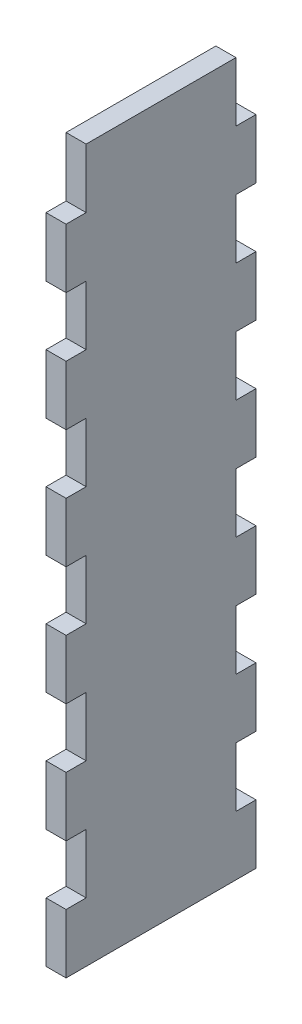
from build123d import *

# Parameters (mm, degrees)
SKETCH1_W           = 32
SKETCH1_H           = 120
BOSS_EXTRUDE1_DEPTH = 3.38
SKETCH2_W           = 3.38
SKETCH2_H           = 10
CUT_EXTRUDE1_DEPTH  = 3.38


with BuildPart() as part:
    # Sketch1 → Boss-Extrude1 (new body)
    with BuildSketch(Plane(origin=(0, 0, 0), x_dir=(0, 0, -1), z_dir=(1, 0, 0))):
        Rectangle(SKETCH1_W, SKETCH1_H)
    extrude(amount=BOSS_EXTRUDE1_DEPTH)

    # Sketch2 → Cut-Extrude1 (cut)
    with BuildSketch(Plane(origin=(3.38, 0, 0), x_dir=(0, 0, -1), z_dir=(1, 0, 0))):
        with Locations((-14.31, 55)):
            Rectangle(SKETCH2_W, SKETCH2_H)
        with Locations((14.31, 55)):
            Rectangle(SKETCH2_W, SKETCH2_H)
        with Locations((14.31, 35)):
            Rectangle(SKETCH2_W, SKETCH2_H)
        with Locations((-14.31, 35)):
            Rectangle(SKETCH2_W, SKETCH2_H)
        with Locations((-14.31, 15)):
            Rectangle(SKETCH2_W, SKETCH2_H)
        with Locations((14.31, 15)):
            Rectangle(SKETCH2_W, SKETCH2_H)
        with Locations((14.31, -5)):
            Rectangle(SKETCH2_W, SKETCH2_H)
        with Locations((-14.31, -5)):
            Rectangle(SKETCH2_W, SKETCH2_H)
        with Locations((14.31, -25)):
            Rectangle(SKETCH2_W, SKETCH2_H)
        with Locations((-14.31, -25)):
            Rectangle(SKETCH2_W, SKETCH2_H)
        with Locations((-14.31, -45)):
            Rectangle(SKETCH2_W, SKETCH2_H)
        with Locations((14.31, -45)):
            Rectangle(SKETCH2_W, SKETCH2_H)
    extrude(amount=-CUT_EXTRUDE1_DEPTH, mode=Mode.SUBTRACT)


solid = part.part
